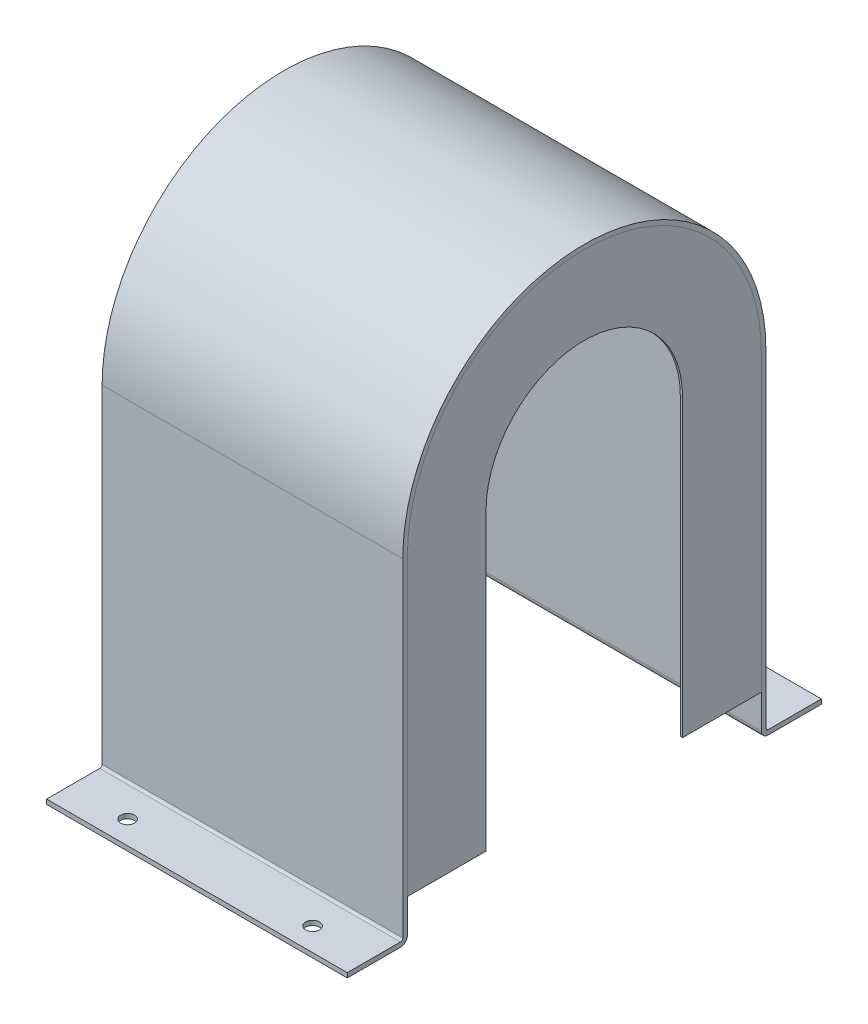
ISO-10303-21;
HEADER;
FILE_DESCRIPTION(('STEP AP214'),'2;1');
FILE_NAME('part.step','',(''),(''),'','','');
FILE_SCHEMA(('AUTOMOTIVE_DESIGN { 1 0 10303 214 1 1 1 1 }'));
ENDSEC;
DATA;
#1=APPLICATION_CONTEXT('core data for automotive mechanical design processes');
#2=APPLICATION_PROTOCOL_DEFINITION('international standard','automotive_design',2000,#1);
#3=PRODUCT_CONTEXT('',#1,'mechanical');
#4=PRODUCT('Part','Part','',(#3));
#5=PRODUCT_RELATED_PRODUCT_CATEGORY('part','',(#4));
#6=PRODUCT_DEFINITION_FORMATION('','',#4);
#7=PRODUCT_DEFINITION_CONTEXT('part definition',#1,'design');
#8=PRODUCT_DEFINITION('design','',#6,#7);
#9=PRODUCT_DEFINITION_SHAPE('','',#8);
#10=(LENGTH_UNIT() NAMED_UNIT(*) SI_UNIT(.MILLI.,.METRE.));
#11=(NAMED_UNIT(*) PLANE_ANGLE_UNIT() SI_UNIT($,.RADIAN.));
#12=(NAMED_UNIT(*) SI_UNIT($,.STERADIAN.) SOLID_ANGLE_UNIT());
#13=UNCERTAINTY_MEASURE_WITH_UNIT(LENGTH_MEASURE(1.E-05),#10,'distance_accuracy_value','');
#14=(GEOMETRIC_REPRESENTATION_CONTEXT(3) GLOBAL_UNCERTAINTY_ASSIGNED_CONTEXT((#13)) GLOBAL_UNIT_ASSIGNED_CONTEXT((#10,
#11,#12)) REPRESENTATION_CONTEXT('',''));
#15=CARTESIAN_POINT('',(0.,0.,0.));
#16=DIRECTION('',(0.,0.,1.));
#17=DIRECTION('',(1.,0.,0.));
#18=AXIS2_PLACEMENT_3D('',#15,#16,#17);
#19=CARTESIAN_POINT('',(-128.,-255.,153.));
#20=DIRECTION('',(0.,-1.,0.));
#21=DIRECTION('',(0.,0.,-1.));
#22=AXIS2_PLACEMENT_3D('',#19,#20,#21);
#23=PLANE('',#22);
#24=DIRECTION('',(-1.,0.,0.));
#25=VECTOR('',#24,1.);
#26=CARTESIAN_POINT('',(130.,-255.,85.));
#27=LINE('',#26,#25);
#28=CARTESIAN_POINT('',(-128.,-255.,85.));
#29=VERTEX_POINT('',#28);
#30=CARTESIAN_POINT('',(-130.,-255.,85.));
#31=VERTEX_POINT('',#30);
#32=EDGE_CURVE('E186',#29,#31,#27,.T.);
#33=ORIENTED_EDGE('',*,*,#32,.F.);
#34=DIRECTION('',(0.,0.,-1.));
#35=VECTOR('',#34,1.);
#36=CARTESIAN_POINT('',(-128.,-255.,153.));
#37=LINE('',#36,#35);
#38=CARTESIAN_POINT('',(-128.,-255.,153.));
#39=VERTEX_POINT('',#38);
#40=EDGE_CURVE('E150',#39,#29,#37,.T.);
#41=ORIENTED_EDGE('',*,*,#40,.F.);
#42=DIRECTION('',(-1.,0.,0.));
#43=VECTOR('',#42,1.);
#44=CARTESIAN_POINT('',(-128.,-255.,153.));
#45=LINE('',#44,#43);
#46=CARTESIAN_POINT('',(-130.,-255.,153.));
#47=VERTEX_POINT('',#46);
#48=EDGE_CURVE('E158',#39,#47,#45,.T.);
#49=ORIENTED_EDGE('',*,*,#48,.T.);
#50=DIRECTION('',(0.,0.,-1.));
#51=VECTOR('',#50,1.);
#52=CARTESIAN_POINT('',(-130.,-255.,153.));
#53=LINE('',#52,#51);
#54=EDGE_CURVE('E161',#47,#31,#53,.T.);
#55=ORIENTED_EDGE('',*,*,#54,.T.);
#56=EDGE_LOOP('',(#33,#41,#49,#55));
#57=FACE_BOUND('',#56,.T.);
#58=ADVANCED_FACE('F59',(#57),#23,.T.);
#59=CARTESIAN_POINT('',(-128.,0.,0.));
#60=DIRECTION('',(-1.,0.,0.));
#61=DIRECTION('',(0.,0.,-1.));
#62=AXIS2_PLACEMENT_3D('',#59,#60,#61);
#63=CYLINDRICAL_SURFACE('',#62,85.);
#64=DIRECTION('',(-1.,0.,0.));
#65=VECTOR('',#64,1.);
#66=CARTESIAN_POINT('',(-128.,0.,85.));
#67=LINE('',#66,#65);
#68=CARTESIAN_POINT('',(-130.,0.,85.));
#69=VERTEX_POINT('',#68);
#70=CARTESIAN_POINT('',(-128.,0.,85.));
#71=VERTEX_POINT('',#70);
#72=EDGE_CURVE('E13',#69,#71,#67,.F.);
#73=ORIENTED_EDGE('',*,*,#72,.F.);
#74=CARTESIAN_POINT('',(-130.,0.,0.));
#75=DIRECTION('',(1.,0.,0.));
#76=DIRECTION('',(0.,0.,-1.));
#77=AXIS2_PLACEMENT_3D('',#74,#75,#76);
#78=CIRCLE('',#77,85.);
#79=CARTESIAN_POINT('',(-130.,0.,-85.));
#80=VERTEX_POINT('',#79);
#81=EDGE_CURVE('E133',#80,#69,#78,.T.);
#82=ORIENTED_EDGE('',*,*,#81,.F.);
#83=DIRECTION('',(-1.,0.,0.));
#84=VECTOR('',#83,1.);
#85=CARTESIAN_POINT('',(-128.,0.,-85.));
#86=LINE('',#85,#84);
#87=CARTESIAN_POINT('',(-128.,0.,-85.));
#88=VERTEX_POINT('',#87);
#89=EDGE_CURVE('E67',#80,#88,#86,.F.);
#90=ORIENTED_EDGE('',*,*,#89,.T.);
#91=CARTESIAN_POINT('',(-128.,0.,0.));
#92=DIRECTION('',(1.,0.,0.));
#93=DIRECTION('',(0.,0.,-1.));
#94=AXIS2_PLACEMENT_3D('',#91,#92,#93);
#95=CIRCLE('',#94,85.);
#96=EDGE_CURVE('E138',#88,#71,#95,.T.);
#97=ORIENTED_EDGE('',*,*,#96,.T.);
#98=EDGE_LOOP('',(#73,#82,#90,#97));
#99=FACE_BOUND('',#98,.T.);
#100=ADVANCED_FACE('F137',(#99),#63,.F.);
#101=CARTESIAN_POINT('',(-128.,0.,153.));
#102=DIRECTION('',(0.,0.,1.));
#103=DIRECTION('',(-1.,0.,0.));
#104=AXIS2_PLACEMENT_3D('',#101,#102,#103);
#105=PLANE('',#104);
#106=DIRECTION('',(0.,-1.,0.));
#107=VECTOR('',#106,1.);
#108=CARTESIAN_POINT('',(-130.,0.,153.));
#109=LINE('',#108,#107);
#110=CARTESIAN_POINT('',(-130.,0.,153.));
#111=VERTEX_POINT('',#110);
#112=EDGE_CURVE('E141',#111,#47,#109,.T.);
#113=ORIENTED_EDGE('',*,*,#112,.T.);
#114=ORIENTED_EDGE('',*,*,#48,.F.);
#115=DIRECTION('',(0.,-1.,0.));
#116=VECTOR('',#115,1.);
#117=CARTESIAN_POINT('',(-128.,0.,153.));
#118=LINE('',#117,#116);
#119=CARTESIAN_POINT('',(-128.,0.,153.));
#120=VERTEX_POINT('',#119);
#121=EDGE_CURVE('E145',#120,#39,#118,.T.);
#122=ORIENTED_EDGE('',*,*,#121,.F.);
#123=DIRECTION('',(-1.,0.,0.));
#124=VECTOR('',#123,1.);
#125=CARTESIAN_POINT('',(-128.,0.,153.));
#126=LINE('',#125,#124);
#127=EDGE_CURVE('E128',#120,#111,#126,.T.);
#128=ORIENTED_EDGE('',*,*,#127,.T.);
#129=EDGE_LOOP('',(#113,#114,#122,#128));
#130=FACE_BOUND('',#129,.T.);
#131=ADVANCED_FACE('F61',(#130),#105,.T.);
#132=CARTESIAN_POINT('',(-128.,0.,0.));
#133=DIRECTION('',(-1.,0.,0.));
#134=DIRECTION('',(0.,0.,-1.));
#135=AXIS2_PLACEMENT_3D('',#132,#133,#134);
#136=CYLINDRICAL_SURFACE('',#135,153.);
#137=CARTESIAN_POINT('',(-130.,0.,0.));
#138=DIRECTION('',(-1.,0.,0.));
#139=DIRECTION('',(0.,0.,1.));
#140=AXIS2_PLACEMENT_3D('',#137,#138,#139);
#141=CIRCLE('',#140,153.);
#142=CARTESIAN_POINT('',(-130.,0.,-153.));
#143=VERTEX_POINT('',#142);
#144=EDGE_CURVE('E149',#111,#143,#141,.T.);
#145=ORIENTED_EDGE('',*,*,#144,.F.);
#146=ORIENTED_EDGE('',*,*,#127,.F.);
#147=CARTESIAN_POINT('',(-128.,0.,0.));
#148=DIRECTION('',(-1.,0.,0.));
#149=DIRECTION('',(0.,0.,1.));
#150=AXIS2_PLACEMENT_3D('',#147,#148,#149);
#151=CIRCLE('',#150,153.);
#152=CARTESIAN_POINT('',(-128.,0.,-153.));
#153=VERTEX_POINT('',#152);
#154=EDGE_CURVE('E155',#120,#153,#151,.T.);
#155=ORIENTED_EDGE('',*,*,#154,.T.);
#156=DIRECTION('',(-1.,0.,0.));
#157=VECTOR('',#156,1.);
#158=CARTESIAN_POINT('',(-128.,0.,-153.));
#159=LINE('',#158,#157);
#160=EDGE_CURVE('E170',#153,#143,#159,.T.);
#161=ORIENTED_EDGE('',*,*,#160,.T.);
#162=EDGE_LOOP('',(#145,#146,#155,#161));
#163=FACE_BOUND('',#162,.T.);
#164=ADVANCED_FACE('F197',(#163),#136,.T.);
#165=CARTESIAN_POINT('',(-128.,-255.,-153.));
#166=DIRECTION('',(0.,0.,-1.));
#167=DIRECTION('',(0.,1.,0.));
#168=AXIS2_PLACEMENT_3D('',#165,#166,#167);
#169=PLANE('',#168);
#170=DIRECTION('',(0.,1.,0.));
#171=VECTOR('',#170,1.);
#172=CARTESIAN_POINT('',(-130.,-255.,-153.));
#173=LINE('',#172,#171);
#174=CARTESIAN_POINT('',(-130.,-255.,-153.));
#175=VERTEX_POINT('',#174);
#176=EDGE_CURVE('E164',#175,#143,#173,.T.);
#177=ORIENTED_EDGE('',*,*,#176,.T.);
#178=ORIENTED_EDGE('',*,*,#160,.F.);
#179=DIRECTION('',(0.,1.,0.));
#180=VECTOR('',#179,1.);
#181=CARTESIAN_POINT('',(-128.,-255.,-153.));
#182=LINE('',#181,#180);
#183=CARTESIAN_POINT('',(-128.,-255.,-153.));
#184=VERTEX_POINT('',#183);
#185=EDGE_CURVE('E153',#184,#153,#182,.T.);
#186=ORIENTED_EDGE('',*,*,#185,.F.);
#187=DIRECTION('',(-1.,0.,0.));
#188=VECTOR('',#187,1.);
#189=CARTESIAN_POINT('',(-128.,-255.,-153.));
#190=LINE('',#189,#188);
#191=EDGE_CURVE('E173',#184,#175,#190,.T.);
#192=ORIENTED_EDGE('',*,*,#191,.T.);
#193=EDGE_LOOP('',(#177,#178,#186,#192));
#194=FACE_BOUND('',#193,.T.);
#195=ADVANCED_FACE('F199',(#194),#169,.T.);
#196=DIRECTION('',(-1.,0.,0.));
#197=VECTOR('',#196,1.);
#198=CARTESIAN_POINT('',(130.,-255.,-85.));
#199=LINE('',#198,#197);
#200=CARTESIAN_POINT('',(-128.,-255.,-85.));
#201=VERTEX_POINT('',#200);
#202=CARTESIAN_POINT('',(-130.,-255.,-85.));
#203=VERTEX_POINT('',#202);
#204=EDGE_CURVE('E184',#201,#203,#199,.T.);
#205=ORIENTED_EDGE('',*,*,#204,.T.);
#206=EDGE_CURVE('E135',#203,#175,#53,.T.);
#207=ORIENTED_EDGE('',*,*,#206,.T.);
#208=ORIENTED_EDGE('',*,*,#191,.F.);
#209=EDGE_CURVE('E148',#201,#184,#37,.T.);
#210=ORIENTED_EDGE('',*,*,#209,.F.);
#211=EDGE_LOOP('',(#205,#207,#208,#210));
#212=FACE_BOUND('',#211,.T.);
#213=ADVANCED_FACE('F203',(#212),#23,.T.);
#214=CARTESIAN_POINT('',(-128.,0.,0.));
#215=DIRECTION('',(1.,0.,0.));
#216=DIRECTION('',(0.,0.,1.));
#217=AXIS2_PLACEMENT_3D('',#214,#215,#216);
#218=PLANE('',#217);
#219=DIRECTION('',(0.,-1.,0.));
#220=VECTOR('',#219,1.);
#221=CARTESIAN_POINT('',(-128.,0.,85.));
#222=LINE('',#221,#220);
#223=EDGE_CURVE('E139',#71,#29,#222,.T.);
#224=ORIENTED_EDGE('',*,*,#223,.F.);
#225=ORIENTED_EDGE('',*,*,#96,.F.);
#226=DIRECTION('',(0.,1.,0.));
#227=VECTOR('',#226,1.);
#228=CARTESIAN_POINT('',(-128.,0.,-85.));
#229=LINE('',#228,#227);
#230=EDGE_CURVE('E81',#201,#88,#229,.T.);
#231=ORIENTED_EDGE('',*,*,#230,.F.);
#232=ORIENTED_EDGE('',*,*,#209,.T.);
#233=ORIENTED_EDGE('',*,*,#185,.T.);
#234=ORIENTED_EDGE('',*,*,#154,.F.);
#235=ORIENTED_EDGE('',*,*,#121,.T.);
#236=ORIENTED_EDGE('',*,*,#40,.T.);
#237=EDGE_LOOP('',(#224,#225,#231,#232,#233,#234,#235,#236));
#238=FACE_BOUND('',#237,.T.);
#239=ADVANCED_FACE('F193',(#238),#218,.T.);
#240=CARTESIAN_POINT('',(-130.,0.,0.));
#241=DIRECTION('',(1.,0.,0.));
#242=DIRECTION('',(0.,0.,1.));
#243=AXIS2_PLACEMENT_3D('',#240,#241,#242);
#244=PLANE('',#243);
#245=ORIENTED_EDGE('',*,*,#81,.T.);
#246=DIRECTION('',(0.,1.,0.));
#247=VECTOR('',#246,1.);
#248=CARTESIAN_POINT('',(-130.,0.,85.));
#249=LINE('',#248,#247);
#250=EDGE_CURVE('E73',#31,#69,#249,.T.);
#251=ORIENTED_EDGE('',*,*,#250,.F.);
#252=ORIENTED_EDGE('',*,*,#54,.F.);
#253=ORIENTED_EDGE('',*,*,#112,.F.);
#254=ORIENTED_EDGE('',*,*,#144,.T.);
#255=ORIENTED_EDGE('',*,*,#176,.F.);
#256=ORIENTED_EDGE('',*,*,#206,.F.);
#257=DIRECTION('',(0.,-1.,0.));
#258=VECTOR('',#257,1.);
#259=CARTESIAN_POINT('',(-130.,-255.,-85.));
#260=LINE('',#259,#258);
#261=EDGE_CURVE('E122',#80,#203,#260,.T.);
#262=ORIENTED_EDGE('',*,*,#261,.F.);
#263=EDGE_LOOP('',(#245,#251,#252,#253,#254,#255,#256,#262));
#264=FACE_BOUND('',#263,.T.);
#265=ADVANCED_FACE('F132',(#264),#244,.F.);
#266=CARTESIAN_POINT('',(130.,-255.,-85.));
#267=DIRECTION('',(0.,0.,-1.));
#268=DIRECTION('',(0.,1.,0.));
#269=AXIS2_PLACEMENT_3D('',#266,#267,#268);
#270=PLANE('',#269);
#271=ORIENTED_EDGE('',*,*,#230,.T.);
#272=ORIENTED_EDGE('',*,*,#89,.F.);
#273=ORIENTED_EDGE('',*,*,#261,.T.);
#274=ORIENTED_EDGE('',*,*,#204,.F.);
#275=EDGE_LOOP('',(#271,#272,#273,#274));
#276=FACE_BOUND('',#275,.T.);
#277=ADVANCED_FACE('F121',(#276),#270,.F.);
#278=CARTESIAN_POINT('',(130.,0.,85.));
#279=DIRECTION('',(0.,0.,1.));
#280=DIRECTION('',(0.,-1.,0.));
#281=AXIS2_PLACEMENT_3D('',#278,#279,#280);
#282=PLANE('',#281);
#283=ORIENTED_EDGE('',*,*,#223,.T.);
#284=ORIENTED_EDGE('',*,*,#32,.T.);
#285=ORIENTED_EDGE('',*,*,#250,.T.);
#286=ORIENTED_EDGE('',*,*,#72,.T.);
#287=EDGE_LOOP('',(#283,#284,#285,#286));
#288=FACE_BOUND('',#287,.T.);
#289=ADVANCED_FACE('F190',(#288),#282,.F.);
#290=CLOSED_SHELL('',(#58,#100,#131,#164,#195,#213,#239,#265,#277,#289));
#291=MANIFOLD_SOLID_BREP('B2',#290);
#292=CARTESIAN_POINT('',(128.,-255.,153.));
#293=DIRECTION('',(0.,-1.,0.));
#294=DIRECTION('',(0.,0.,-1.));
#295=AXIS2_PLACEMENT_3D('',#292,#293,#294);
#296=PLANE('',#295);
#297=DIRECTION('',(-1.,0.,0.));
#298=VECTOR('',#297,1.);
#299=CARTESIAN_POINT('',(130.,-255.,85.));
#300=LINE('',#299,#298);
#301=CARTESIAN_POINT('',(130.,-255.,85.));
#302=VERTEX_POINT('',#301);
#303=CARTESIAN_POINT('',(128.,-255.,85.));
#304=VERTEX_POINT('',#303);
#305=EDGE_CURVE('E364',#302,#304,#300,.T.);
#306=ORIENTED_EDGE('',*,*,#305,.F.);
#307=DIRECTION('',(0.,0.,-1.));
#308=VECTOR('',#307,1.);
#309=CARTESIAN_POINT('',(130.,-255.,153.));
#310=LINE('',#309,#308);
#311=CARTESIAN_POINT('',(130.,-255.,153.));
#312=VERTEX_POINT('',#311);
#313=EDGE_CURVE('E383',#312,#302,#310,.T.);
#314=ORIENTED_EDGE('',*,*,#313,.F.);
#315=DIRECTION('',(1.,0.,0.));
#316=VECTOR('',#315,1.);
#317=CARTESIAN_POINT('',(128.,-255.,153.));
#318=LINE('',#317,#316);
#319=CARTESIAN_POINT('',(128.,-255.,153.));
#320=VERTEX_POINT('',#319);
#321=EDGE_CURVE('E297',#320,#312,#318,.T.);
#322=ORIENTED_EDGE('',*,*,#321,.F.);
#323=DIRECTION('',(0.,0.,-1.));
#324=VECTOR('',#323,1.);
#325=CARTESIAN_POINT('',(128.,-255.,153.));
#326=LINE('',#325,#324);
#327=EDGE_CURVE('E409',#320,#304,#326,.T.);
#328=ORIENTED_EDGE('',*,*,#327,.T.);
#329=EDGE_LOOP('',(#306,#314,#322,#328));
#330=FACE_BOUND('',#329,.T.);
#331=ADVANCED_FACE('F293',(#330),#296,.T.);
#332=CARTESIAN_POINT('',(128.,0.,153.));
#333=DIRECTION('',(0.,0.,1.));
#334=DIRECTION('',(1.,0.,0.));
#335=AXIS2_PLACEMENT_3D('',#332,#333,#334);
#336=PLANE('',#335);
#337=DIRECTION('',(0.,-1.,0.));
#338=VECTOR('',#337,1.);
#339=CARTESIAN_POINT('',(130.,0.,153.));
#340=LINE('',#339,#338);
#341=CARTESIAN_POINT('',(130.,0.,153.));
#342=VERTEX_POINT('',#341);
#343=EDGE_CURVE('E384',#342,#312,#340,.T.);
#344=ORIENTED_EDGE('',*,*,#343,.F.);
#345=DIRECTION('',(1.,0.,0.));
#346=VECTOR('',#345,1.);
#347=CARTESIAN_POINT('',(128.,0.,153.));
#348=LINE('',#347,#346);
#349=CARTESIAN_POINT('',(128.,0.,153.));
#350=VERTEX_POINT('',#349);
#351=EDGE_CURVE('E57',#350,#342,#348,.T.);
#352=ORIENTED_EDGE('',*,*,#351,.F.);
#353=DIRECTION('',(0.,-1.,0.));
#354=VECTOR('',#353,1.);
#355=CARTESIAN_POINT('',(128.,0.,153.));
#356=LINE('',#355,#354);
#357=EDGE_CURVE('E395',#350,#320,#356,.T.);
#358=ORIENTED_EDGE('',*,*,#357,.T.);
#359=ORIENTED_EDGE('',*,*,#321,.T.);
#360=EDGE_LOOP('',(#344,#352,#358,#359));
#361=FACE_BOUND('',#360,.T.);
#362=ADVANCED_FACE('F295',(#361),#336,.T.);
#363=CARTESIAN_POINT('',(128.,0.,0.));
#364=DIRECTION('',(1.,0.,0.));
#365=DIRECTION('',(0.,0.,-1.));
#366=AXIS2_PLACEMENT_3D('',#363,#364,#365);
#367=CYLINDRICAL_SURFACE('',#366,153.);
#368=CARTESIAN_POINT('',(130.,0.,0.));
#369=DIRECTION('',(-1.,0.,0.));
#370=DIRECTION('',(0.,0.,1.));
#371=AXIS2_PLACEMENT_3D('',#368,#369,#370);
#372=CIRCLE('',#371,153.);
#373=CARTESIAN_POINT('',(130.,0.,-153.));
#374=VERTEX_POINT('',#373);
#375=EDGE_CURVE('E393',#342,#374,#372,.T.);
#376=ORIENTED_EDGE('',*,*,#375,.T.);
#377=DIRECTION('',(1.,0.,0.));
#378=VECTOR('',#377,1.);
#379=CARTESIAN_POINT('',(128.,0.,-153.));
#380=LINE('',#379,#378);
#381=CARTESIAN_POINT('',(128.,0.,-153.));
#382=VERTEX_POINT('',#381);
#383=EDGE_CURVE('E302',#382,#374,#380,.T.);
#384=ORIENTED_EDGE('',*,*,#383,.F.);
#385=CARTESIAN_POINT('',(128.,0.,0.));
#386=DIRECTION('',(-1.,0.,0.));
#387=DIRECTION('',(0.,0.,1.));
#388=AXIS2_PLACEMENT_3D('',#385,#386,#387);
#389=CIRCLE('',#388,153.);
#390=EDGE_CURVE('E397',#350,#382,#389,.T.);
#391=ORIENTED_EDGE('',*,*,#390,.F.);
#392=ORIENTED_EDGE('',*,*,#351,.T.);
#393=EDGE_LOOP('',(#376,#384,#391,#392));
#394=FACE_BOUND('',#393,.T.);
#395=ADVANCED_FACE('F434',(#394),#367,.T.);
#396=CARTESIAN_POINT('',(128.,-255.,-153.));
#397=DIRECTION('',(0.,0.,-1.));
#398=DIRECTION('',(0.,1.,0.));
#399=AXIS2_PLACEMENT_3D('',#396,#397,#398);
#400=PLANE('',#399);
#401=DIRECTION('',(0.,1.,0.));
#402=VECTOR('',#401,1.);
#403=CARTESIAN_POINT('',(130.,-255.,-153.));
#404=LINE('',#403,#402);
#405=CARTESIAN_POINT('',(130.,-255.,-153.));
#406=VERTEX_POINT('',#405);
#407=EDGE_CURVE('E386',#406,#374,#404,.T.);
#408=ORIENTED_EDGE('',*,*,#407,.F.);
#409=DIRECTION('',(1.,0.,0.));
#410=VECTOR('',#409,1.);
#411=CARTESIAN_POINT('',(128.,-255.,-153.));
#412=LINE('',#411,#410);
#413=CARTESIAN_POINT('',(128.,-255.,-153.));
#414=VERTEX_POINT('',#413);
#415=EDGE_CURVE('E381',#414,#406,#412,.T.);
#416=ORIENTED_EDGE('',*,*,#415,.F.);
#417=DIRECTION('',(0.,1.,0.));
#418=VECTOR('',#417,1.);
#419=CARTESIAN_POINT('',(128.,-255.,-153.));
#420=LINE('',#419,#418);
#421=EDGE_CURVE('E402',#414,#382,#420,.T.);
#422=ORIENTED_EDGE('',*,*,#421,.T.);
#423=ORIENTED_EDGE('',*,*,#383,.T.);
#424=EDGE_LOOP('',(#408,#416,#422,#423));
#425=FACE_BOUND('',#424,.T.);
#426=ADVANCED_FACE('F431',(#425),#400,.T.);
#427=DIRECTION('',(-1.,0.,0.));
#428=VECTOR('',#427,1.);
#429=CARTESIAN_POINT('',(130.,-255.,-85.));
#430=LINE('',#429,#428);
#431=CARTESIAN_POINT('',(130.,-255.,-85.));
#432=VERTEX_POINT('',#431);
#433=CARTESIAN_POINT('',(128.,-255.,-85.));
#434=VERTEX_POINT('',#433);
#435=EDGE_CURVE('E357',#432,#434,#430,.T.);
#436=ORIENTED_EDGE('',*,*,#435,.T.);
#437=EDGE_CURVE('E414',#434,#414,#326,.T.);
#438=ORIENTED_EDGE('',*,*,#437,.T.);
#439=ORIENTED_EDGE('',*,*,#415,.T.);
#440=EDGE_CURVE('E372',#432,#406,#310,.T.);
#441=ORIENTED_EDGE('',*,*,#440,.F.);
#442=EDGE_LOOP('',(#436,#438,#439,#441));
#443=FACE_BOUND('',#442,.T.);
#444=ADVANCED_FACE('F379',(#443),#296,.T.);
#445=CARTESIAN_POINT('',(128.,0.,0.));
#446=DIRECTION('',(-1.,0.,0.));
#447=DIRECTION('',(0.,0.,1.));
#448=AXIS2_PLACEMENT_3D('',#445,#446,#447);
#449=PLANE('',#448);
#450=DIRECTION('',(0.,1.,0.));
#451=VECTOR('',#450,1.);
#452=CARTESIAN_POINT('',(128.,0.,85.));
#453=LINE('',#452,#451);
#454=CARTESIAN_POINT('',(128.,0.,85.));
#455=VERTEX_POINT('',#454);
#456=EDGE_CURVE('E318',#304,#455,#453,.T.);
#457=ORIENTED_EDGE('',*,*,#456,.F.);
#458=ORIENTED_EDGE('',*,*,#327,.F.);
#459=ORIENTED_EDGE('',*,*,#357,.F.);
#460=ORIENTED_EDGE('',*,*,#390,.T.);
#461=ORIENTED_EDGE('',*,*,#421,.F.);
#462=ORIENTED_EDGE('',*,*,#437,.F.);
#463=DIRECTION('',(0.,-1.,0.));
#464=VECTOR('',#463,1.);
#465=CARTESIAN_POINT('',(128.,0.,-85.));
#466=LINE('',#465,#464);
#467=CARTESIAN_POINT('',(128.,0.,-85.));
#468=VERTEX_POINT('',#467);
#469=EDGE_CURVE('E360',#468,#434,#466,.T.);
#470=ORIENTED_EDGE('',*,*,#469,.F.);
#471=CARTESIAN_POINT('',(128.,0.,0.));
#472=DIRECTION('',(1.,0.,0.));
#473=DIRECTION('',(0.,0.,-1.));
#474=AXIS2_PLACEMENT_3D('',#471,#472,#473);
#475=CIRCLE('',#474,85.);
#476=EDGE_CURVE('E388',#468,#455,#475,.T.);
#477=ORIENTED_EDGE('',*,*,#476,.T.);
#478=EDGE_LOOP('',(#457,#458,#459,#460,#461,#462,#470,#477));
#479=FACE_BOUND('',#478,.T.);
#480=ADVANCED_FACE('F429',(#479),#449,.T.);
#481=CARTESIAN_POINT('',(130.,0.,0.));
#482=DIRECTION('',(-1.,0.,0.));
#483=DIRECTION('',(0.,0.,1.));
#484=AXIS2_PLACEMENT_3D('',#481,#482,#483);
#485=PLANE('',#484);
#486=ORIENTED_EDGE('',*,*,#313,.T.);
#487=DIRECTION('',(0.,1.,0.));
#488=VECTOR('',#487,1.);
#489=CARTESIAN_POINT('',(130.,0.,85.));
#490=LINE('',#489,#488);
#491=CARTESIAN_POINT('',(130.,0.,85.));
#492=VERTEX_POINT('',#491);
#493=EDGE_CURVE('E377',#302,#492,#490,.T.);
#494=ORIENTED_EDGE('',*,*,#493,.T.);
#495=CARTESIAN_POINT('',(130.,0.,0.));
#496=DIRECTION('',(1.,0.,0.));
#497=DIRECTION('',(0.,0.,-1.));
#498=AXIS2_PLACEMENT_3D('',#495,#496,#497);
#499=CIRCLE('',#498,85.);
#500=CARTESIAN_POINT('',(130.,0.,-85.));
#501=VERTEX_POINT('',#500);
#502=EDGE_CURVE('E376',#501,#492,#499,.T.);
#503=ORIENTED_EDGE('',*,*,#502,.F.);
#504=DIRECTION('',(0.,-1.,0.));
#505=VECTOR('',#504,1.);
#506=CARTESIAN_POINT('',(130.,-255.,-85.));
#507=LINE('',#506,#505);
#508=EDGE_CURVE('E310',#501,#432,#507,.T.);
#509=ORIENTED_EDGE('',*,*,#508,.T.);
#510=ORIENTED_EDGE('',*,*,#440,.T.);
#511=ORIENTED_EDGE('',*,*,#407,.T.);
#512=ORIENTED_EDGE('',*,*,#375,.F.);
#513=ORIENTED_EDGE('',*,*,#343,.T.);
#514=EDGE_LOOP('',(#486,#494,#503,#509,#510,#511,#512,#513));
#515=FACE_BOUND('',#514,.T.);
#516=ADVANCED_FACE('F370',(#515),#485,.F.);
#517=CARTESIAN_POINT('',(128.,0.,0.));
#518=DIRECTION('',(1.,0.,0.));
#519=DIRECTION('',(0.,0.,-1.));
#520=AXIS2_PLACEMENT_3D('',#517,#518,#519);
#521=CYLINDRICAL_SURFACE('',#520,85.);
#522=ORIENTED_EDGE('',*,*,#502,.T.);
#523=DIRECTION('',(-1.,0.,0.));
#524=VECTOR('',#523,1.);
#525=CARTESIAN_POINT('',(130.,0.,85.));
#526=LINE('',#525,#524);
#527=EDGE_CURVE('E421',#492,#455,#526,.T.);
#528=ORIENTED_EDGE('',*,*,#527,.T.);
#529=ORIENTED_EDGE('',*,*,#476,.F.);
#530=DIRECTION('',(-1.,0.,0.));
#531=VECTOR('',#530,1.);
#532=CARTESIAN_POINT('',(130.,0.,-85.));
#533=LINE('',#532,#531);
#534=EDGE_CURVE('E365',#501,#468,#533,.T.);
#535=ORIENTED_EDGE('',*,*,#534,.F.);
#536=EDGE_LOOP('',(#522,#528,#529,#535));
#537=FACE_BOUND('',#536,.T.);
#538=ADVANCED_FACE('F427',(#537),#521,.F.);
#539=CARTESIAN_POINT('',(130.,-255.,-85.));
#540=DIRECTION('',(0.,0.,-1.));
#541=DIRECTION('',(0.,1.,0.));
#542=AXIS2_PLACEMENT_3D('',#539,#540,#541);
#543=PLANE('',#542);
#544=ORIENTED_EDGE('',*,*,#469,.T.);
#545=ORIENTED_EDGE('',*,*,#435,.F.);
#546=ORIENTED_EDGE('',*,*,#508,.F.);
#547=ORIENTED_EDGE('',*,*,#534,.T.);
#548=EDGE_LOOP('',(#544,#545,#546,#547));
#549=FACE_BOUND('',#548,.T.);
#550=ADVANCED_FACE('F358',(#549),#543,.F.);
#551=CARTESIAN_POINT('',(130.,0.,85.));
#552=DIRECTION('',(0.,0.,1.));
#553=DIRECTION('',(0.,-1.,0.));
#554=AXIS2_PLACEMENT_3D('',#551,#552,#553);
#555=PLANE('',#554);
#556=ORIENTED_EDGE('',*,*,#456,.T.);
#557=ORIENTED_EDGE('',*,*,#527,.F.);
#558=ORIENTED_EDGE('',*,*,#493,.F.);
#559=ORIENTED_EDGE('',*,*,#305,.T.);
#560=EDGE_LOOP('',(#556,#557,#558,#559));
#561=FACE_BOUND('',#560,.T.);
#562=ADVANCED_FACE('F437',(#561),#555,.F.);
#563=CLOSED_SHELL('',(#331,#362,#395,#426,#444,#480,#516,#538,#550,#562));
#564=MANIFOLD_SOLID_BREP('B7',#563);
#565=CARTESIAN_POINT('',(130.,0.,-157.));
#566=DIRECTION('',(0.,0.,-1.));
#567=DIRECTION('',(0.,1.,0.));
#568=AXIS2_PLACEMENT_3D('',#565,#566,#567);
#569=PLANE('',#568);
#570=DIRECTION('',(0.,-1.,0.));
#571=VECTOR('',#570,1.);
#572=CARTESIAN_POINT('',(-130.,0.,-157.));
#573=LINE('',#572,#571);
#574=CARTESIAN_POINT('',(-130.,0.,-157.));
#575=VERTEX_POINT('',#574);
#576=CARTESIAN_POINT('',(-130.,-284.,-157.));
#577=VERTEX_POINT('',#576);
#578=EDGE_CURVE('E664',#575,#577,#573,.T.);
#579=ORIENTED_EDGE('',*,*,#578,.F.);
#580=DIRECTION('',(-1.,0.,0.));
#581=VECTOR('',#580,1.);
#582=CARTESIAN_POINT('',(130.,0.,-157.));
#583=LINE('',#582,#581);
#584=CARTESIAN_POINT('',(130.,0.,-157.));
#585=VERTEX_POINT('',#584);
#586=EDGE_CURVE('E291',#585,#575,#583,.T.);
#587=ORIENTED_EDGE('',*,*,#586,.F.);
#588=DIRECTION('',(0.,-1.,0.));
#589=VECTOR('',#588,1.);
#590=CARTESIAN_POINT('',(130.,0.,-157.));
#591=LINE('',#590,#589);
#592=CARTESIAN_POINT('',(130.,-284.,-157.));
#593=VERTEX_POINT('',#592);
#594=EDGE_CURVE('E704',#585,#593,#591,.T.);
#595=ORIENTED_EDGE('',*,*,#594,.T.);
#596=DIRECTION('',(-1.,0.,0.));
#597=VECTOR('',#596,1.);
#598=CARTESIAN_POINT('',(130.,-284.,-157.));
#599=LINE('',#598,#597);
#600=EDGE_CURVE('E521',#593,#577,#599,.T.);
#601=ORIENTED_EDGE('',*,*,#600,.T.);
#602=EDGE_LOOP('',(#579,#587,#595,#601));
#603=FACE_BOUND('',#602,.T.);
#604=ADVANCED_FACE('F518',(#603),#569,.T.);
#605=CARTESIAN_POINT('',(130.,0.,0.));
#606=DIRECTION('',(-1.,0.,0.));
#607=DIRECTION('',(0.,0.,1.));
#608=AXIS2_PLACEMENT_3D('',#605,#606,#607);
#609=CYLINDRICAL_SURFACE('',#608,157.);
#610=CARTESIAN_POINT('',(-130.,0.,0.));
#611=DIRECTION('',(1.,0.,0.));
#612=DIRECTION('',(0.,0.,-1.));
#613=AXIS2_PLACEMENT_3D('',#610,#611,#612);
#614=CIRCLE('',#613,157.);
#615=CARTESIAN_POINT('',(-130.,0.,157.));
#616=VERTEX_POINT('',#615);
#617=EDGE_CURVE('E587',#575,#616,#614,.T.);
#618=ORIENTED_EDGE('',*,*,#617,.T.);
#619=DIRECTION('',(-1.,0.,0.));
#620=VECTOR('',#619,1.);
#621=CARTESIAN_POINT('',(130.,0.,157.));
#622=LINE('',#621,#620);
#623=CARTESIAN_POINT('',(130.,0.,157.));
#624=VERTEX_POINT('',#623);
#625=EDGE_CURVE('E527',#624,#616,#622,.T.);
#626=ORIENTED_EDGE('',*,*,#625,.F.);
#627=CARTESIAN_POINT('',(130.,0.,0.));
#628=DIRECTION('',(1.,0.,0.));
#629=DIRECTION('',(0.,0.,-1.));
#630=AXIS2_PLACEMENT_3D('',#627,#628,#629);
#631=CIRCLE('',#630,157.);
#632=EDGE_CURVE('E642',#585,#624,#631,.T.);
#633=ORIENTED_EDGE('',*,*,#632,.F.);
#634=ORIENTED_EDGE('',*,*,#586,.T.);
#635=EDGE_LOOP('',(#618,#626,#633,#634));
#636=FACE_BOUND('',#635,.T.);
#637=ADVANCED_FACE('F833',(#636),#609,.T.);
#638=CARTESIAN_POINT('',(130.,0.,157.));
#639=DIRECTION('',(0.,0.,-1.));
#640=DIRECTION('',(0.,1.,0.));
#641=AXIS2_PLACEMENT_3D('',#638,#639,#640);
#642=PLANE('',#641);
#643=DIRECTION('',(0.,-1.,0.));
#644=VECTOR('',#643,1.);
#645=CARTESIAN_POINT('',(-130.,0.,157.));
#646=LINE('',#645,#644);
#647=CARTESIAN_POINT('',(-130.,-284.,157.));
#648=VERTEX_POINT('',#647);
#649=EDGE_CURVE('E649',#616,#648,#646,.T.);
#650=ORIENTED_EDGE('',*,*,#649,.T.);
#651=DIRECTION('',(-1.,0.,0.));
#652=VECTOR('',#651,1.);
#653=CARTESIAN_POINT('',(130.,-284.,157.));
#654=LINE('',#653,#652);
#655=CARTESIAN_POINT('',(130.,-284.,157.));
#656=VERTEX_POINT('',#655);
#657=EDGE_CURVE('E646',#656,#648,#654,.T.);
#658=ORIENTED_EDGE('',*,*,#657,.F.);
#659=DIRECTION('',(0.,-1.,0.));
#660=VECTOR('',#659,1.);
#661=CARTESIAN_POINT('',(130.,0.,157.));
#662=LINE('',#661,#660);
#663=EDGE_CURVE('E635',#624,#656,#662,.T.);
#664=ORIENTED_EDGE('',*,*,#663,.F.);
#665=ORIENTED_EDGE('',*,*,#625,.T.);
#666=EDGE_LOOP('',(#650,#658,#664,#665));
#667=FACE_BOUND('',#666,.T.);
#668=ADVANCED_FACE('F647',(#667),#642,.F.);
#669=CARTESIAN_POINT('',(130.,-284.,159.));
#670=DIRECTION('',(-1.,0.,0.));
#671=DIRECTION('',(0.,0.,1.));
#672=AXIS2_PLACEMENT_3D('',#669,#670,#671);
#673=CYLINDRICAL_SURFACE('',#672,2.);
#674=CARTESIAN_POINT('',(-130.,-284.,159.));
#675=DIRECTION('',(-1.,0.,0.));
#676=DIRECTION('',(0.,0.,1.));
#677=AXIS2_PLACEMENT_3D('',#674,#675,#676);
#678=CIRCLE('',#677,2.);
#679=CARTESIAN_POINT('',(-130.,-286.,159.));
#680=VERTEX_POINT('',#679);
#681=EDGE_CURVE('E701',#648,#680,#678,.T.);
#682=ORIENTED_EDGE('',*,*,#681,.T.);
#683=DIRECTION('',(-1.,0.,0.));
#684=VECTOR('',#683,1.);
#685=CARTESIAN_POINT('',(130.,-286.,159.));
#686=LINE('',#685,#684);
#687=CARTESIAN_POINT('',(130.,-286.,159.));
#688=VERTEX_POINT('',#687);
#689=EDGE_CURVE('E652',#688,#680,#686,.T.);
#690=ORIENTED_EDGE('',*,*,#689,.F.);
#691=CARTESIAN_POINT('',(130.,-284.,159.));
#692=DIRECTION('',(-1.,0.,0.));
#693=DIRECTION('',(0.,0.,1.));
#694=AXIS2_PLACEMENT_3D('',#691,#692,#693);
#695=CIRCLE('',#694,2.);
#696=EDGE_CURVE('E640',#656,#688,#695,.T.);
#697=ORIENTED_EDGE('',*,*,#696,.F.);
#698=ORIENTED_EDGE('',*,*,#657,.T.);
#699=EDGE_LOOP('',(#682,#690,#697,#698));
#700=FACE_BOUND('',#699,.T.);
#701=ADVANCED_FACE('F654',(#700),#673,.F.);
#702=CARTESIAN_POINT('',(130.,-286.,159.));
#703=DIRECTION('',(0.,-1.,0.));
#704=DIRECTION('',(0.,0.,-1.));
#705=AXIS2_PLACEMENT_3D('',#702,#703,#704);
#706=PLANE('',#705);
#707=CARTESIAN_POINT('',(80.,-286.,185.));
#708=DIRECTION('',(0.,1.,0.));
#709=DIRECTION('',(0.,0.,1.));
#710=AXIS2_PLACEMENT_3D('',#707,#708,#709);
#711=CIRCLE('',#710,6.);
#712=CARTESIAN_POINT('',(80.,-286.,191.));
#713=VERTEX_POINT('',#712);
#714=EDGE_CURVE('E783',#713,#713,#711,.T.);
#715=ORIENTED_EDGE('',*,*,#714,.F.);
#716=EDGE_LOOP('',(#715));
#717=FACE_BOUND('',#716,.T.);
#718=CARTESIAN_POINT('',(-80.,-286.,185.));
#719=DIRECTION('',(0.,1.,0.));
#720=DIRECTION('',(0.,0.,1.));
#721=AXIS2_PLACEMENT_3D('',#718,#719,#720);
#722=CIRCLE('',#721,6.);
#723=CARTESIAN_POINT('',(-80.,-286.,191.));
#724=VERTEX_POINT('',#723);
#725=EDGE_CURVE('E777',#724,#724,#722,.T.);
#726=ORIENTED_EDGE('',*,*,#725,.F.);
#727=EDGE_LOOP('',(#726));
#728=FACE_BOUND('',#727,.T.);
#729=DIRECTION('',(0.,0.,1.));
#730=VECTOR('',#729,1.);
#731=CARTESIAN_POINT('',(-130.,-286.,159.));
#732=LINE('',#731,#730);
#733=CARTESIAN_POINT('',(-130.,-286.,205.));
#734=VERTEX_POINT('',#733);
#735=EDGE_CURVE('E699',#680,#734,#732,.T.);
#736=ORIENTED_EDGE('',*,*,#735,.T.);
#737=DIRECTION('',(-1.,0.,0.));
#738=VECTOR('',#737,1.);
#739=CARTESIAN_POINT('',(130.,-286.,205.));
#740=LINE('',#739,#738);
#741=CARTESIAN_POINT('',(130.,-286.,205.));
#742=VERTEX_POINT('',#741);
#743=EDGE_CURVE('E708',#742,#734,#740,.T.);
#744=ORIENTED_EDGE('',*,*,#743,.F.);
#745=DIRECTION('',(0.,0.,1.));
#746=VECTOR('',#745,1.);
#747=CARTESIAN_POINT('',(130.,-286.,159.));
#748=LINE('',#747,#746);
#749=EDGE_CURVE('E657',#688,#742,#748,.T.);
#750=ORIENTED_EDGE('',*,*,#749,.F.);
#751=ORIENTED_EDGE('',*,*,#689,.T.);
#752=EDGE_LOOP('',(#736,#744,#750,#751));
#753=FACE_BOUND('',#752,.T.);
#754=ADVANCED_FACE('F738',(#717,#728,#753),#706,.F.);
#755=CARTESIAN_POINT('',(130.,-286.,205.));
#756=DIRECTION('',(0.,0.,-1.));
#757=DIRECTION('',(-1.,0.,0.));
#758=AXIS2_PLACEMENT_3D('',#755,#756,#757);
#759=PLANE('',#758);
#760=DIRECTION('',(0.,-1.,0.));
#761=VECTOR('',#760,1.);
#762=CARTESIAN_POINT('',(-130.,-286.,205.));
#763=LINE('',#762,#761);
#764=CARTESIAN_POINT('',(-130.,-290.,205.));
#765=VERTEX_POINT('',#764);
#766=EDGE_CURVE('E696',#734,#765,#763,.T.);
#767=ORIENTED_EDGE('',*,*,#766,.T.);
#768=DIRECTION('',(-1.,0.,0.));
#769=VECTOR('',#768,1.);
#770=CARTESIAN_POINT('',(130.,-290.,205.));
#771=LINE('',#770,#769);
#772=CARTESIAN_POINT('',(130.,-290.,205.));
#773=VERTEX_POINT('',#772);
#774=EDGE_CURVE('E711',#773,#765,#771,.T.);
#775=ORIENTED_EDGE('',*,*,#774,.F.);
#776=DIRECTION('',(0.,-1.,0.));
#777=VECTOR('',#776,1.);
#778=CARTESIAN_POINT('',(130.,-286.,205.));
#779=LINE('',#778,#777);
#780=EDGE_CURVE('E659',#742,#773,#779,.T.);
#781=ORIENTED_EDGE('',*,*,#780,.F.);
#782=ORIENTED_EDGE('',*,*,#743,.T.);
#783=EDGE_LOOP('',(#767,#775,#781,#782));
#784=FACE_BOUND('',#783,.T.);
#785=ADVANCED_FACE('F748',(#784),#759,.F.);
#786=CARTESIAN_POINT('',(130.,-290.,159.));
#787=DIRECTION('',(0.,-1.,0.));
#788=DIRECTION('',(0.,0.,-1.));
#789=AXIS2_PLACEMENT_3D('',#786,#787,#788);
#790=PLANE('',#789);
#791=CARTESIAN_POINT('',(80.,-290.,185.));
#792=DIRECTION('',(0.,1.,0.));
#793=DIRECTION('',(0.,0.,1.));
#794=AXIS2_PLACEMENT_3D('',#791,#792,#793);
#795=CIRCLE('',#794,6.);
#796=CARTESIAN_POINT('',(80.,-290.,191.));
#797=VERTEX_POINT('',#796);
#798=EDGE_CURVE('E780',#797,#797,#795,.T.);
#799=ORIENTED_EDGE('',*,*,#798,.T.);
#800=EDGE_LOOP('',(#799));
#801=FACE_BOUND('',#800,.T.);
#802=CARTESIAN_POINT('',(-80.,-290.,185.));
#803=DIRECTION('',(0.,1.,0.));
#804=DIRECTION('',(0.,0.,1.));
#805=AXIS2_PLACEMENT_3D('',#802,#803,#804);
#806=CIRCLE('',#805,6.);
#807=CARTESIAN_POINT('',(-80.,-290.,191.));
#808=VERTEX_POINT('',#807);
#809=EDGE_CURVE('E668',#808,#808,#806,.T.);
#810=ORIENTED_EDGE('',*,*,#809,.T.);
#811=EDGE_LOOP('',(#810));
#812=FACE_BOUND('',#811,.T.);
#813=DIRECTION('',(0.,0.,1.));
#814=VECTOR('',#813,1.);
#815=CARTESIAN_POINT('',(-130.,-290.,159.));
#816=LINE('',#815,#814);
#817=CARTESIAN_POINT('',(-130.,-290.,159.));
#818=VERTEX_POINT('',#817);
#819=EDGE_CURVE('E693',#818,#765,#816,.T.);
#820=ORIENTED_EDGE('',*,*,#819,.F.);
#821=DIRECTION('',(-1.,0.,0.));
#822=VECTOR('',#821,1.);
#823=CARTESIAN_POINT('',(130.,-290.,159.));
#824=LINE('',#823,#822);
#825=CARTESIAN_POINT('',(130.,-290.,159.));
#826=VERTEX_POINT('',#825);
#827=EDGE_CURVE('E713',#826,#818,#824,.T.);
#828=ORIENTED_EDGE('',*,*,#827,.F.);
#829=DIRECTION('',(0.,0.,1.));
#830=VECTOR('',#829,1.);
#831=CARTESIAN_POINT('',(130.,-290.,159.));
#832=LINE('',#831,#830);
#833=EDGE_CURVE('E745',#826,#773,#832,.T.);
#834=ORIENTED_EDGE('',*,*,#833,.T.);
#835=ORIENTED_EDGE('',*,*,#774,.T.);
#836=EDGE_LOOP('',(#820,#828,#834,#835));
#837=FACE_BOUND('',#836,.T.);
#838=ADVANCED_FACE('F751',(#801,#812,#837),#790,.T.);
#839=CARTESIAN_POINT('',(130.,-284.,159.));
#840=DIRECTION('',(-1.,0.,0.));
#841=DIRECTION('',(0.,0.,1.));
#842=AXIS2_PLACEMENT_3D('',#839,#840,#841);
#843=CYLINDRICAL_SURFACE('',#842,6.00000000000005);
#844=CARTESIAN_POINT('',(-130.,-284.,159.));
#845=DIRECTION('',(-1.,0.,0.));
#846=DIRECTION('',(0.,0.,1.));
#847=AXIS2_PLACEMENT_3D('',#844,#845,#846);
#848=CIRCLE('',#847,6.00000000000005);
#849=CARTESIAN_POINT('',(-130.,-284.,153.));
#850=VERTEX_POINT('',#849);
#851=EDGE_CURVE('E690',#850,#818,#848,.T.);
#852=ORIENTED_EDGE('',*,*,#851,.F.);
#853=DIRECTION('',(-1.,0.,0.));
#854=VECTOR('',#853,1.);
#855=CARTESIAN_POINT('',(130.,-284.,153.));
#856=LINE('',#855,#854);
#857=CARTESIAN_POINT('',(130.,-284.,153.));
#858=VERTEX_POINT('',#857);
#859=EDGE_CURVE('E715',#858,#850,#856,.T.);
#860=ORIENTED_EDGE('',*,*,#859,.F.);
#861=CARTESIAN_POINT('',(130.,-284.,159.));
#862=DIRECTION('',(-1.,0.,0.));
#863=DIRECTION('',(0.,0.,1.));
#864=AXIS2_PLACEMENT_3D('',#861,#862,#863);
#865=CIRCLE('',#864,6.00000000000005);
#866=EDGE_CURVE('E752',#858,#826,#865,.T.);
#867=ORIENTED_EDGE('',*,*,#866,.T.);
#868=ORIENTED_EDGE('',*,*,#827,.T.);
#869=EDGE_LOOP('',(#852,#860,#867,#868));
#870=FACE_BOUND('',#869,.T.);
#871=ADVANCED_FACE('F854',(#870),#843,.T.);
#872=CARTESIAN_POINT('',(130.,0.,153.));
#873=DIRECTION('',(0.,0.,-1.));
#874=DIRECTION('',(0.,1.,0.));
#875=AXIS2_PLACEMENT_3D('',#872,#873,#874);
#876=PLANE('',#875);
#877=DIRECTION('',(0.,-1.,0.));
#878=VECTOR('',#877,1.);
#879=CARTESIAN_POINT('',(-130.,0.,153.));
#880=LINE('',#879,#878);
#881=CARTESIAN_POINT('',(-130.,0.,153.));
#882=VERTEX_POINT('',#881);
#883=EDGE_CURVE('E687',#882,#850,#880,.T.);
#884=ORIENTED_EDGE('',*,*,#883,.F.);
#885=DIRECTION('',(-1.,0.,0.));
#886=VECTOR('',#885,1.);
#887=CARTESIAN_POINT('',(130.,0.,153.));
#888=LINE('',#887,#886);
#889=CARTESIAN_POINT('',(130.,0.,153.));
#890=VERTEX_POINT('',#889);
#891=EDGE_CURVE('E717',#890,#882,#888,.T.);
#892=ORIENTED_EDGE('',*,*,#891,.F.);
#893=DIRECTION('',(0.,-1.,0.));
#894=VECTOR('',#893,1.);
#895=CARTESIAN_POINT('',(130.,0.,153.));
#896=LINE('',#895,#894);
#897=EDGE_CURVE('E754',#890,#858,#896,.T.);
#898=ORIENTED_EDGE('',*,*,#897,.T.);
#899=ORIENTED_EDGE('',*,*,#859,.T.);
#900=EDGE_LOOP('',(#884,#892,#898,#899));
#901=FACE_BOUND('',#900,.T.);
#902=ADVANCED_FACE('F858',(#901),#876,.T.);
#903=CARTESIAN_POINT('',(130.,0.,0.));
#904=DIRECTION('',(-1.,0.,0.));
#905=DIRECTION('',(0.,0.,1.));
#906=AXIS2_PLACEMENT_3D('',#903,#904,#905);
#907=CYLINDRICAL_SURFACE('',#906,153.);
#908=CARTESIAN_POINT('',(-130.,0.,0.));
#909=DIRECTION('',(1.,0.,0.));
#910=DIRECTION('',(0.,0.,-1.));
#911=AXIS2_PLACEMENT_3D('',#908,#909,#910);
#912=CIRCLE('',#911,153.);
#913=CARTESIAN_POINT('',(-130.,0.,-153.));
#914=VERTEX_POINT('',#913);
#915=EDGE_CURVE('E684',#914,#882,#912,.T.);
#916=ORIENTED_EDGE('',*,*,#915,.F.);
#917=DIRECTION('',(-1.,0.,0.));
#918=VECTOR('',#917,1.);
#919=CARTESIAN_POINT('',(130.,0.,-153.));
#920=LINE('',#919,#918);
#921=CARTESIAN_POINT('',(130.,0.,-153.));
#922=VERTEX_POINT('',#921);
#923=EDGE_CURVE('E719',#922,#914,#920,.T.);
#924=ORIENTED_EDGE('',*,*,#923,.F.);
#925=CARTESIAN_POINT('',(130.,0.,0.));
#926=DIRECTION('',(1.,0.,0.));
#927=DIRECTION('',(0.,0.,-1.));
#928=AXIS2_PLACEMENT_3D('',#925,#926,#927);
#929=CIRCLE('',#928,153.);
#930=EDGE_CURVE('E759',#922,#890,#929,.T.);
#931=ORIENTED_EDGE('',*,*,#930,.T.);
#932=ORIENTED_EDGE('',*,*,#891,.T.);
#933=EDGE_LOOP('',(#916,#924,#931,#932));
#934=FACE_BOUND('',#933,.T.);
#935=ADVANCED_FACE('F862',(#934),#907,.F.);
#936=CARTESIAN_POINT('',(130.,0.,-153.));
#937=DIRECTION('',(0.,0.,-1.));
#938=DIRECTION('',(0.,1.,0.));
#939=AXIS2_PLACEMENT_3D('',#936,#937,#938);
#940=PLANE('',#939);
#941=DIRECTION('',(0.,-1.,0.));
#942=VECTOR('',#941,1.);
#943=CARTESIAN_POINT('',(-130.,0.,-153.));
#944=LINE('',#943,#942);
#945=CARTESIAN_POINT('',(-130.,-284.,-153.));
#946=VERTEX_POINT('',#945);
#947=EDGE_CURVE('E682',#914,#946,#944,.T.);
#948=ORIENTED_EDGE('',*,*,#947,.T.);
#949=DIRECTION('',(-1.,0.,0.));
#950=VECTOR('',#949,1.);
#951=CARTESIAN_POINT('',(130.,-284.,-153.));
#952=LINE('',#951,#950);
#953=CARTESIAN_POINT('',(130.,-284.,-153.));
#954=VERTEX_POINT('',#953);
#955=EDGE_CURVE('E721',#954,#946,#952,.T.);
#956=ORIENTED_EDGE('',*,*,#955,.F.);
#957=DIRECTION('',(0.,-1.,0.));
#958=VECTOR('',#957,1.);
#959=CARTESIAN_POINT('',(130.,0.,-153.));
#960=LINE('',#959,#958);
#961=EDGE_CURVE('E762',#922,#954,#960,.T.);
#962=ORIENTED_EDGE('',*,*,#961,.F.);
#963=ORIENTED_EDGE('',*,*,#923,.T.);
#964=EDGE_LOOP('',(#948,#956,#962,#963));
#965=FACE_BOUND('',#964,.T.);
#966=ADVANCED_FACE('F866',(#965),#940,.F.);
#967=CARTESIAN_POINT('',(130.,-284.,-159.));
#968=DIRECTION('',(-1.,0.,0.));
#969=DIRECTION('',(0.,0.,1.));
#970=AXIS2_PLACEMENT_3D('',#967,#968,#969);
#971=CYLINDRICAL_SURFACE('',#970,6.00000000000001);
#972=CARTESIAN_POINT('',(-130.,-284.,-159.));
#973=DIRECTION('',(1.,0.,0.));
#974=DIRECTION('',(0.,0.,-1.));
#975=AXIS2_PLACEMENT_3D('',#972,#973,#974);
#976=CIRCLE('',#975,6.00000000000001);
#977=CARTESIAN_POINT('',(-130.,-290.,-159.));
#978=VERTEX_POINT('',#977);
#979=EDGE_CURVE('E680',#946,#978,#976,.T.);
#980=ORIENTED_EDGE('',*,*,#979,.T.);
#981=DIRECTION('',(-1.,0.,0.));
#982=VECTOR('',#981,1.);
#983=CARTESIAN_POINT('',(130.,-290.,-159.));
#984=LINE('',#983,#982);
#985=CARTESIAN_POINT('',(130.,-290.,-159.));
#986=VERTEX_POINT('',#985);
#987=EDGE_CURVE('E724',#986,#978,#984,.T.);
#988=ORIENTED_EDGE('',*,*,#987,.F.);
#989=CARTESIAN_POINT('',(130.,-284.,-159.));
#990=DIRECTION('',(1.,0.,0.));
#991=DIRECTION('',(0.,0.,-1.));
#992=AXIS2_PLACEMENT_3D('',#989,#990,#991);
#993=CIRCLE('',#992,6.00000000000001);
#994=EDGE_CURVE('E764',#954,#986,#993,.T.);
#995=ORIENTED_EDGE('',*,*,#994,.F.);
#996=ORIENTED_EDGE('',*,*,#955,.T.);
#997=EDGE_LOOP('',(#980,#988,#995,#996));
#998=FACE_BOUND('',#997,.T.);
#999=ADVANCED_FACE('F808',(#998),#971,.T.);
#1000=CARTESIAN_POINT('',(130.,-290.,-159.));
#1001=DIRECTION('',(0.,1.,0.));
#1002=DIRECTION('',(0.,0.,1.));
#1003=AXIS2_PLACEMENT_3D('',#1000,#1001,#1002);
#1004=PLANE('',#1003);
#1005=CARTESIAN_POINT('',(80.,-290.,-185.));
#1006=DIRECTION('',(0.,-1.,0.));
#1007=DIRECTION('',(0.,0.,-1.));
#1008=AXIS2_PLACEMENT_3D('',#1005,#1006,#1007);
#1009=CIRCLE('',#1008,6.);
#1010=CARTESIAN_POINT('',(80.,-290.,-191.));
#1011=VERTEX_POINT('',#1010);
#1012=EDGE_CURVE('E792',#1011,#1011,#1009,.T.);
#1013=ORIENTED_EDGE('',*,*,#1012,.F.);
#1014=EDGE_LOOP('',(#1013));
#1015=FACE_BOUND('',#1014,.T.);
#1016=CARTESIAN_POINT('',(-80.,-290.,-185.));
#1017=DIRECTION('',(0.,-1.,0.));
#1018=DIRECTION('',(0.,0.,-1.));
#1019=AXIS2_PLACEMENT_3D('',#1016,#1017,#1018);
#1020=CIRCLE('',#1019,6.);
#1021=CARTESIAN_POINT('',(-80.,-290.,-191.));
#1022=VERTEX_POINT('',#1021);
#1023=EDGE_CURVE('E786',#1022,#1022,#1020,.T.);
#1024=ORIENTED_EDGE('',*,*,#1023,.F.);
#1025=EDGE_LOOP('',(#1024));
#1026=FACE_BOUND('',#1025,.T.);
#1027=DIRECTION('',(0.,0.,-1.));
#1028=VECTOR('',#1027,1.);
#1029=CARTESIAN_POINT('',(-130.,-290.,-159.));
#1030=LINE('',#1029,#1028);
#1031=CARTESIAN_POINT('',(-130.,-290.,-205.));
#1032=VERTEX_POINT('',#1031);
#1033=EDGE_CURVE('E677',#978,#1032,#1030,.T.);
#1034=ORIENTED_EDGE('',*,*,#1033,.T.);
#1035=DIRECTION('',(-1.,0.,0.));
#1036=VECTOR('',#1035,1.);
#1037=CARTESIAN_POINT('',(130.,-290.,-205.));
#1038=LINE('',#1037,#1036);
#1039=CARTESIAN_POINT('',(130.,-290.,-205.));
#1040=VERTEX_POINT('',#1039);
#1041=EDGE_CURVE('E727',#1040,#1032,#1038,.T.);
#1042=ORIENTED_EDGE('',*,*,#1041,.F.);
#1043=DIRECTION('',(0.,0.,-1.));
#1044=VECTOR('',#1043,1.);
#1045=CARTESIAN_POINT('',(130.,-290.,-159.));
#1046=LINE('',#1045,#1044);
#1047=EDGE_CURVE('E766',#986,#1040,#1046,.T.);
#1048=ORIENTED_EDGE('',*,*,#1047,.F.);
#1049=ORIENTED_EDGE('',*,*,#987,.T.);
#1050=EDGE_LOOP('',(#1034,#1042,#1048,#1049));
#1051=FACE_BOUND('',#1050,.T.);
#1052=ADVANCED_FACE('F804',(#1015,#1026,#1051),#1004,.F.);
#1053=CARTESIAN_POINT('',(130.,-286.,-205.));
#1054=DIRECTION('',(0.,0.,-1.));
#1055=DIRECTION('',(-1.,0.,0.));
#1056=AXIS2_PLACEMENT_3D('',#1053,#1054,#1055);
#1057=PLANE('',#1056);
#1058=DIRECTION('',(0.,-1.,0.));
#1059=VECTOR('',#1058,1.);
#1060=CARTESIAN_POINT('',(-130.,-286.,-205.));
#1061=LINE('',#1060,#1059);
#1062=CARTESIAN_POINT('',(-130.,-286.,-205.));
#1063=VERTEX_POINT('',#1062);
#1064=EDGE_CURVE('E674',#1063,#1032,#1061,.T.);
#1065=ORIENTED_EDGE('',*,*,#1064,.F.);
#1066=DIRECTION('',(-1.,0.,0.));
#1067=VECTOR('',#1066,1.);
#1068=CARTESIAN_POINT('',(130.,-286.,-205.));
#1069=LINE('',#1068,#1067);
#1070=CARTESIAN_POINT('',(130.,-286.,-205.));
#1071=VERTEX_POINT('',#1070);
#1072=EDGE_CURVE('E729',#1071,#1063,#1069,.T.);
#1073=ORIENTED_EDGE('',*,*,#1072,.F.);
#1074=DIRECTION('',(0.,-1.,0.));
#1075=VECTOR('',#1074,1.);
#1076=CARTESIAN_POINT('',(130.,-286.,-205.));
#1077=LINE('',#1076,#1075);
#1078=EDGE_CURVE('E768',#1071,#1040,#1077,.T.);
#1079=ORIENTED_EDGE('',*,*,#1078,.T.);
#1080=ORIENTED_EDGE('',*,*,#1041,.T.);
#1081=EDGE_LOOP('',(#1065,#1073,#1079,#1080));
#1082=FACE_BOUND('',#1081,.T.);
#1083=ADVANCED_FACE('F807',(#1082),#1057,.T.);
#1084=CARTESIAN_POINT('',(130.,-286.,-159.));
#1085=DIRECTION('',(0.,1.,0.));
#1086=DIRECTION('',(0.,0.,1.));
#1087=AXIS2_PLACEMENT_3D('',#1084,#1085,#1086);
#1088=PLANE('',#1087);
#1089=CARTESIAN_POINT('',(80.,-286.,-185.));
#1090=DIRECTION('',(0.,-1.,0.));
#1091=DIRECTION('',(0.,0.,-1.));
#1092=AXIS2_PLACEMENT_3D('',#1089,#1090,#1091);
#1093=CIRCLE('',#1092,6.);
#1094=CARTESIAN_POINT('',(80.,-286.,-191.));
#1095=VERTEX_POINT('',#1094);
#1096=EDGE_CURVE('E795',#1095,#1095,#1093,.T.);
#1097=ORIENTED_EDGE('',*,*,#1096,.T.);
#1098=EDGE_LOOP('',(#1097));
#1099=FACE_BOUND('',#1098,.T.);
#1100=CARTESIAN_POINT('',(-80.,-286.,-185.));
#1101=DIRECTION('',(0.,-1.,0.));
#1102=DIRECTION('',(0.,0.,-1.));
#1103=AXIS2_PLACEMENT_3D('',#1100,#1101,#1102);
#1104=CIRCLE('',#1103,6.);
#1105=CARTESIAN_POINT('',(-80.,-286.,-191.));
#1106=VERTEX_POINT('',#1105);
#1107=EDGE_CURVE('E789',#1106,#1106,#1104,.T.);
#1108=ORIENTED_EDGE('',*,*,#1107,.T.);
#1109=EDGE_LOOP('',(#1108));
#1110=FACE_BOUND('',#1109,.T.);
#1111=DIRECTION('',(0.,0.,-1.));
#1112=VECTOR('',#1111,1.);
#1113=CARTESIAN_POINT('',(-130.,-286.,-159.));
#1114=LINE('',#1113,#1112);
#1115=CARTESIAN_POINT('',(-130.,-286.,-159.));
#1116=VERTEX_POINT('',#1115);
#1117=EDGE_CURVE('E671',#1116,#1063,#1114,.T.);
#1118=ORIENTED_EDGE('',*,*,#1117,.F.);
#1119=DIRECTION('',(-1.,0.,0.));
#1120=VECTOR('',#1119,1.);
#1121=CARTESIAN_POINT('',(130.,-286.,-159.));
#1122=LINE('',#1121,#1120);
#1123=CARTESIAN_POINT('',(130.,-286.,-159.));
#1124=VERTEX_POINT('',#1123);
#1125=EDGE_CURVE('E730',#1124,#1116,#1122,.T.);
#1126=ORIENTED_EDGE('',*,*,#1125,.F.);
#1127=DIRECTION('',(0.,0.,-1.));
#1128=VECTOR('',#1127,1.);
#1129=CARTESIAN_POINT('',(130.,-286.,-159.));
#1130=LINE('',#1129,#1128);
#1131=EDGE_CURVE('E771',#1124,#1071,#1130,.T.);
#1132=ORIENTED_EDGE('',*,*,#1131,.T.);
#1133=ORIENTED_EDGE('',*,*,#1072,.T.);
#1134=EDGE_LOOP('',(#1118,#1126,#1132,#1133));
#1135=FACE_BOUND('',#1134,.T.);
#1136=ADVANCED_FACE('F822',(#1099,#1110,#1135),#1088,.T.);
#1137=CARTESIAN_POINT('',(130.,-284.,-159.));
#1138=DIRECTION('',(-1.,0.,0.));
#1139=DIRECTION('',(0.,0.,1.));
#1140=AXIS2_PLACEMENT_3D('',#1137,#1138,#1139);
#1141=CYLINDRICAL_SURFACE('',#1140,2.);
#1142=CARTESIAN_POINT('',(-130.,-284.,-159.));
#1143=DIRECTION('',(1.,0.,0.));
#1144=DIRECTION('',(0.,0.,-1.));
#1145=AXIS2_PLACEMENT_3D('',#1142,#1143,#1144);
#1146=CIRCLE('',#1145,2.);
#1147=EDGE_CURVE('E667',#577,#1116,#1146,.T.);
#1148=ORIENTED_EDGE('',*,*,#1147,.F.);
#1149=ORIENTED_EDGE('',*,*,#600,.F.);
#1150=CARTESIAN_POINT('',(130.,-284.,-159.));
#1151=DIRECTION('',(1.,0.,0.));
#1152=DIRECTION('',(0.,0.,-1.));
#1153=AXIS2_PLACEMENT_3D('',#1150,#1151,#1152);
#1154=CIRCLE('',#1153,2.);
#1155=EDGE_CURVE('E774',#593,#1124,#1154,.T.);
#1156=ORIENTED_EDGE('',*,*,#1155,.T.);
#1157=ORIENTED_EDGE('',*,*,#1125,.T.);
#1158=EDGE_LOOP('',(#1148,#1149,#1156,#1157));
#1159=FACE_BOUND('',#1158,.T.);
#1160=ADVANCED_FACE('F732',(#1159),#1141,.F.);
#1161=CARTESIAN_POINT('',(130.,-284.,-159.));
#1162=DIRECTION('',(1.,0.,0.));
#1163=DIRECTION('',(0.,0.,-1.));
#1164=AXIS2_PLACEMENT_3D('',#1161,#1162,#1163);
#1165=PLANE('',#1164);
#1166=ORIENTED_EDGE('',*,*,#594,.F.);
#1167=ORIENTED_EDGE('',*,*,#632,.T.);
#1168=ORIENTED_EDGE('',*,*,#663,.T.);
#1169=ORIENTED_EDGE('',*,*,#696,.T.);
#1170=ORIENTED_EDGE('',*,*,#749,.T.);
#1171=ORIENTED_EDGE('',*,*,#780,.T.);
#1172=ORIENTED_EDGE('',*,*,#833,.F.);
#1173=ORIENTED_EDGE('',*,*,#866,.F.);
#1174=ORIENTED_EDGE('',*,*,#897,.F.);
#1175=ORIENTED_EDGE('',*,*,#930,.F.);
#1176=ORIENTED_EDGE('',*,*,#961,.T.);
#1177=ORIENTED_EDGE('',*,*,#994,.T.);
#1178=ORIENTED_EDGE('',*,*,#1047,.T.);
#1179=ORIENTED_EDGE('',*,*,#1078,.F.);
#1180=ORIENTED_EDGE('',*,*,#1131,.F.);
#1181=ORIENTED_EDGE('',*,*,#1155,.F.);
#1182=EDGE_LOOP('',(#1166,#1167,#1168,#1169,#1170,#1171,#1172,#1173,#1174,#1175,#1176,#1177,
#1178,#1179,#1180,#1181));
#1183=FACE_BOUND('',#1182,.T.);
#1184=ADVANCED_FACE('F638',(#1183),#1165,.T.);
#1185=CARTESIAN_POINT('',(-130.,-284.,-159.));
#1186=DIRECTION('',(1.,0.,0.));
#1187=DIRECTION('',(0.,0.,-1.));
#1188=AXIS2_PLACEMENT_3D('',#1185,#1186,#1187);
#1189=PLANE('',#1188);
#1190=ORIENTED_EDGE('',*,*,#578,.T.);
#1191=ORIENTED_EDGE('',*,*,#1147,.T.);
#1192=ORIENTED_EDGE('',*,*,#1117,.T.);
#1193=ORIENTED_EDGE('',*,*,#1064,.T.);
#1194=ORIENTED_EDGE('',*,*,#1033,.F.);
#1195=ORIENTED_EDGE('',*,*,#979,.F.);
#1196=ORIENTED_EDGE('',*,*,#947,.F.);
#1197=ORIENTED_EDGE('',*,*,#915,.T.);
#1198=ORIENTED_EDGE('',*,*,#883,.T.);
#1199=ORIENTED_EDGE('',*,*,#851,.T.);
#1200=ORIENTED_EDGE('',*,*,#819,.T.);
#1201=ORIENTED_EDGE('',*,*,#766,.F.);
#1202=ORIENTED_EDGE('',*,*,#735,.F.);
#1203=ORIENTED_EDGE('',*,*,#681,.F.);
#1204=ORIENTED_EDGE('',*,*,#649,.F.);
#1205=ORIENTED_EDGE('',*,*,#617,.F.);
#1206=EDGE_LOOP('',(#1190,#1191,#1192,#1193,#1194,#1195,#1196,#1197,#1198,#1199,#1200,#1201,
#1202,#1203,#1204,#1205));
#1207=FACE_BOUND('',#1206,.T.);
#1208=ADVANCED_FACE('F734',(#1207),#1189,.F.);
#1209=CARTESIAN_POINT('',(-80.,-290.,185.));
#1210=DIRECTION('',(0.,1.,0.));
#1211=DIRECTION('',(0.,0.,1.));
#1212=AXIS2_PLACEMENT_3D('',#1209,#1210,#1211);
#1213=CYLINDRICAL_SURFACE('',#1212,6.);
#1214=ORIENTED_EDGE('',*,*,#809,.F.);
#1215=EDGE_LOOP('',(#1214));
#1216=FACE_BOUND('',#1215,.T.);
#1217=ORIENTED_EDGE('',*,*,#725,.T.);
#1218=EDGE_LOOP('',(#1217));
#1219=FACE_BOUND('',#1218,.T.);
#1220=ADVANCED_FACE('F918',(#1216,#1219),#1213,.F.);
#1221=CARTESIAN_POINT('',(80.,-290.,185.));
#1222=DIRECTION('',(0.,1.,0.));
#1223=DIRECTION('',(0.,0.,1.));
#1224=AXIS2_PLACEMENT_3D('',#1221,#1222,#1223);
#1225=CYLINDRICAL_SURFACE('',#1224,6.);
#1226=ORIENTED_EDGE('',*,*,#798,.F.);
#1227=EDGE_LOOP('',(#1226));
#1228=FACE_BOUND('',#1227,.T.);
#1229=ORIENTED_EDGE('',*,*,#714,.T.);
#1230=EDGE_LOOP('',(#1229));
#1231=FACE_BOUND('',#1230,.T.);
#1232=ADVANCED_FACE('F940',(#1228,#1231),#1225,.F.);
#1233=CARTESIAN_POINT('',(-80.,-290.,-185.));
#1234=DIRECTION('',(0.,1.,0.));
#1235=DIRECTION('',(0.,0.,1.));
#1236=AXIS2_PLACEMENT_3D('',#1233,#1234,#1235);
#1237=CYLINDRICAL_SURFACE('',#1236,6.);
#1238=ORIENTED_EDGE('',*,*,#1023,.T.);
#1239=EDGE_LOOP('',(#1238));
#1240=FACE_BOUND('',#1239,.T.);
#1241=ORIENTED_EDGE('',*,*,#1107,.F.);
#1242=EDGE_LOOP('',(#1241));
#1243=FACE_BOUND('',#1242,.T.);
#1244=ADVANCED_FACE('F949',(#1240,#1243),#1237,.F.);
#1245=CARTESIAN_POINT('',(80.,-290.,-185.));
#1246=DIRECTION('',(0.,1.,0.));
#1247=DIRECTION('',(0.,0.,1.));
#1248=AXIS2_PLACEMENT_3D('',#1245,#1246,#1247);
#1249=CYLINDRICAL_SURFACE('',#1248,6.);
#1250=ORIENTED_EDGE('',*,*,#1012,.T.);
#1251=EDGE_LOOP('',(#1250));
#1252=FACE_BOUND('',#1251,.T.);
#1253=ORIENTED_EDGE('',*,*,#1096,.F.);
#1254=EDGE_LOOP('',(#1253));
#1255=FACE_BOUND('',#1254,.T.);
#1256=ADVANCED_FACE('F801',(#1252,#1255),#1249,.F.);
#1257=CLOSED_SHELL('',(#604,#637,#668,#701,#754,#785,#838,#871,#902,#935,#966,#999,#1052,#1083,
#1136,#1160,#1184,#1208,#1220,#1232,#1244,#1256));
#1258=MANIFOLD_SOLID_BREP('B51',#1257);
#1259=ADVANCED_BREP_SHAPE_REPRESENTATION('',(#18,#291,#564,#1258),#14);
#1260=SHAPE_DEFINITION_REPRESENTATION(#9,#1259);
ENDSEC;
END-ISO-10303-21;
